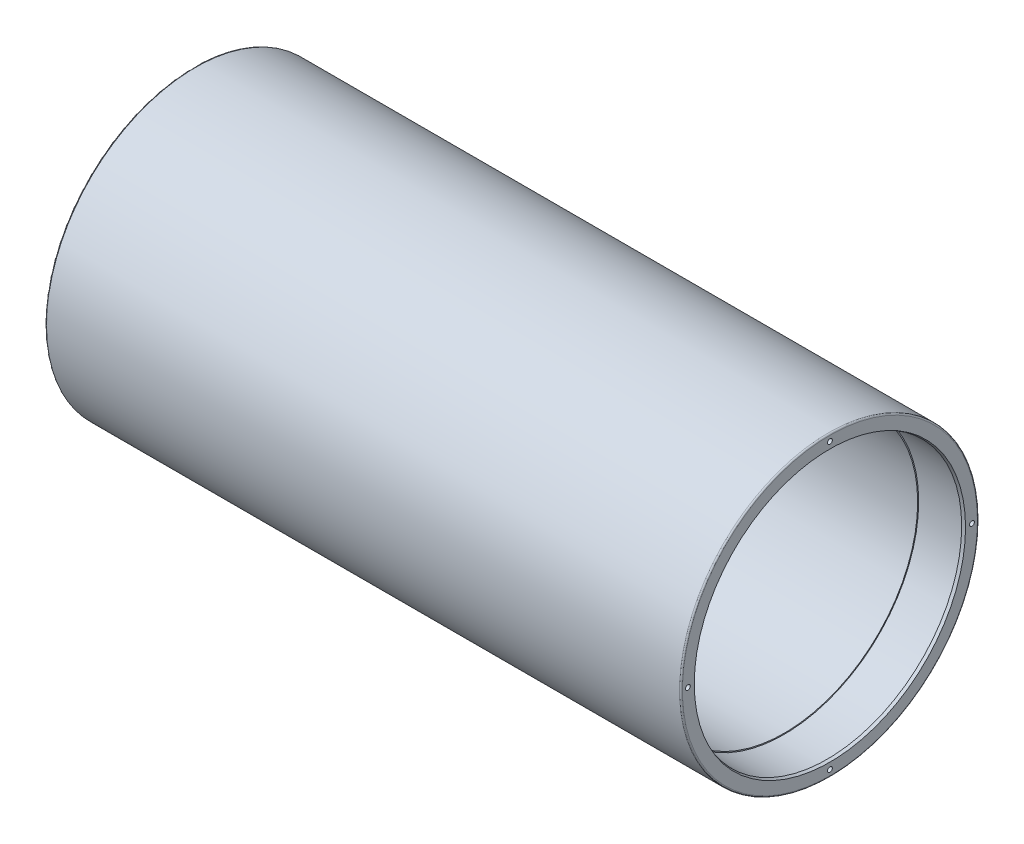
ISO-10303-21;
HEADER;
FILE_DESCRIPTION(('STEP AP214'),'2;1');
FILE_NAME('part.step','',(''),(''),'','','');
FILE_SCHEMA(('AUTOMOTIVE_DESIGN { 1 0 10303 214 1 1 1 1 }'));
ENDSEC;
DATA;
#1=APPLICATION_CONTEXT('core data for automotive mechanical design processes');
#2=APPLICATION_PROTOCOL_DEFINITION('international standard','automotive_design',2000,#1);
#3=PRODUCT_CONTEXT('',#1,'mechanical');
#4=PRODUCT('Part','Part','',(#3));
#5=PRODUCT_RELATED_PRODUCT_CATEGORY('part','',(#4));
#6=PRODUCT_DEFINITION_FORMATION('','',#4);
#7=PRODUCT_DEFINITION_CONTEXT('part definition',#1,'design');
#8=PRODUCT_DEFINITION('design','',#6,#7);
#9=PRODUCT_DEFINITION_SHAPE('','',#8);
#10=(LENGTH_UNIT() NAMED_UNIT(*) SI_UNIT(.MILLI.,.METRE.));
#11=(NAMED_UNIT(*) PLANE_ANGLE_UNIT() SI_UNIT($,.RADIAN.));
#12=(NAMED_UNIT(*) SI_UNIT($,.STERADIAN.) SOLID_ANGLE_UNIT());
#13=UNCERTAINTY_MEASURE_WITH_UNIT(LENGTH_MEASURE(1.E-05),#10,'distance_accuracy_value','');
#14=(GEOMETRIC_REPRESENTATION_CONTEXT(3) GLOBAL_UNCERTAINTY_ASSIGNED_CONTEXT((#13)) GLOBAL_UNIT_ASSIGNED_CONTEXT((#10,
#11,#12)) REPRESENTATION_CONTEXT('',''));
#15=CARTESIAN_POINT('',(0.,0.,0.));
#16=DIRECTION('',(0.,0.,1.));
#17=DIRECTION('',(1.,0.,0.));
#18=AXIS2_PLACEMENT_3D('',#15,#16,#17);
#19=CARTESIAN_POINT('',(196.985032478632,0.,0.));
#20=DIRECTION('',(1.,0.,0.));
#21=DIRECTION('',(0.,0.,-1.));
#22=AXIS2_PLACEMENT_3D('',#19,#20,#21);
#23=CYLINDRICAL_SURFACE('',#22,74.041);
#24=CARTESIAN_POINT('',(46.0593563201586,0.,0.));
#25=DIRECTION('',(1.,0.,0.));
#26=DIRECTION('',(0.,0.,-1.));
#27=AXIS2_PLACEMENT_3D('',#24,#25,#26);
#28=CIRCLE('',#27,74.041);
#29=CARTESIAN_POINT('',(46.0593563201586,0.,-74.041));
#30=VERTEX_POINT('',#29);
#31=EDGE_CURVE('E133',#30,#30,#28,.T.);
#32=ORIENTED_EDGE('',*,*,#31,.F.);
#33=EDGE_LOOP('',(#32));
#34=FACE_BOUND('',#33,.T.);
#35=CARTESIAN_POINT('',(327.025,0.,0.));
#36=DIRECTION('',(1.,0.,0.));
#37=DIRECTION('',(0.,0.,-1.));
#38=AXIS2_PLACEMENT_3D('',#35,#36,#37);
#39=CIRCLE('',#38,74.041);
#40=CARTESIAN_POINT('',(327.025,0.,-74.041));
#41=VERTEX_POINT('',#40);
#42=EDGE_CURVE('E132',#41,#41,#39,.T.);
#43=ORIENTED_EDGE('',*,*,#42,.T.);
#44=EDGE_LOOP('',(#43));
#45=FACE_BOUND('',#44,.T.);
#46=ADVANCED_FACE('F39',(#34,#45),#23,.F.);
#47=CARTESIAN_POINT('',(196.985032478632,0.,0.));
#48=DIRECTION('',(1.,0.,0.));
#49=DIRECTION('',(0.,0.,-1.));
#50=AXIS2_PLACEMENT_3D('',#47,#48,#49);
#51=CYLINDRICAL_SURFACE('',#50,82.55);
#52=CARTESIAN_POINT('',(0.79375000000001,0.,0.));
#53=DIRECTION('',(-1.,0.,0.));
#54=DIRECTION('',(0.,0.,1.));
#55=AXIS2_PLACEMENT_3D('',#52,#53,#54);
#56=CIRCLE('',#55,82.55);
#57=CARTESIAN_POINT('',(0.79375000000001,0.,82.55));
#58=VERTEX_POINT('',#57);
#59=EDGE_CURVE('E156',#58,#58,#56,.F.);
#60=ORIENTED_EDGE('',*,*,#59,.T.);
#61=EDGE_LOOP('',(#60));
#62=FACE_BOUND('',#61,.T.);
#63=CARTESIAN_POINT('',(351.63125,0.,0.));
#64=DIRECTION('',(1.,0.,0.));
#65=DIRECTION('',(0.,0.,-1.));
#66=AXIS2_PLACEMENT_3D('',#63,#64,#65);
#67=CIRCLE('',#66,82.55);
#68=CARTESIAN_POINT('',(351.63125,0.,-82.55));
#69=VERTEX_POINT('',#68);
#70=EDGE_CURVE('E153',#69,#69,#67,.F.);
#71=ORIENTED_EDGE('',*,*,#70,.T.);
#72=EDGE_LOOP('',(#71));
#73=FACE_BOUND('',#72,.T.);
#74=ADVANCED_FACE('F170',(#62,#73),#51,.T.);
#75=CARTESIAN_POINT('',(0.,82.55,0.));
#76=DIRECTION('',(-1.,0.,0.));
#77=DIRECTION('',(0.,0.,1.));
#78=AXIS2_PLACEMENT_3D('',#75,#76,#77);
#79=PLANE('',#78);
#80=CARTESIAN_POINT('',(0.,0.,0.));
#81=DIRECTION('',(-1.,0.,0.));
#82=DIRECTION('',(0.,0.,1.));
#83=AXIS2_PLACEMENT_3D('',#80,#81,#82);
#84=CIRCLE('',#83,81.75625);
#85=CARTESIAN_POINT('',(0.,0.,81.75625));
#86=VERTEX_POINT('',#85);
#87=EDGE_CURVE('E47',#86,#86,#84,.T.);
#88=ORIENTED_EDGE('',*,*,#87,.T.);
#89=EDGE_LOOP('',(#88));
#90=FACE_BOUND('',#89,.T.);
#91=CARTESIAN_POINT('',(0.,0.,0.));
#92=DIRECTION('',(-1.,0.,0.));
#93=DIRECTION('',(0.,0.,1.));
#94=AXIS2_PLACEMENT_3D('',#91,#92,#93);
#95=CIRCLE('',#94,67.2481803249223);
#96=CARTESIAN_POINT('',(0.,0.,67.2481803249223));
#97=VERTEX_POINT('',#96);
#98=EDGE_CURVE('E139',#97,#97,#95,.F.);
#99=ORIENTED_EDGE('',*,*,#98,.T.);
#100=EDGE_LOOP('',(#99));
#101=FACE_BOUND('',#100,.T.);
#102=CARTESIAN_POINT('',(0.,8.24757721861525E-13,78.74));
#103=DIRECTION('',(-1.,0.,0.));
#104=DIRECTION('',(0.,0.,1.));
#105=AXIS2_PLACEMENT_3D('',#102,#103,#104);
#106=CIRCLE('',#105,1.35254999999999);
#107=CARTESIAN_POINT('',(0.,8.24757721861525E-13,80.09255));
#108=VERTEX_POINT('',#107);
#109=EDGE_CURVE('E105',#108,#108,#106,.T.);
#110=ORIENTED_EDGE('',*,*,#109,.F.);
#111=EDGE_LOOP('',(#110));
#112=FACE_BOUND('',#111,.T.);
#113=CARTESIAN_POINT('',(0.,-78.74,0.));
#114=DIRECTION('',(-1.,0.,0.));
#115=DIRECTION('',(0.,0.,1.));
#116=AXIS2_PLACEMENT_3D('',#113,#114,#115);
#117=CIRCLE('',#116,1.35254999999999);
#118=CARTESIAN_POINT('',(0.,-78.74,1.35254999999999));
#119=VERTEX_POINT('',#118);
#120=EDGE_CURVE('E111',#119,#119,#117,.T.);
#121=ORIENTED_EDGE('',*,*,#120,.F.);
#122=EDGE_LOOP('',(#121));
#123=FACE_BOUND('',#122,.T.);
#124=CARTESIAN_POINT('',(0.,-2.74919240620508E-13,-78.74));
#125=DIRECTION('',(-1.,0.,0.));
#126=DIRECTION('',(0.,0.,1.));
#127=AXIS2_PLACEMENT_3D('',#124,#125,#126);
#128=CIRCLE('',#127,1.35254999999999);
#129=CARTESIAN_POINT('',(0.,-2.74919240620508E-13,-77.38745));
#130=VERTEX_POINT('',#129);
#131=EDGE_CURVE('E117',#130,#130,#128,.T.);
#132=ORIENTED_EDGE('',*,*,#131,.F.);
#133=EDGE_LOOP('',(#132));
#134=FACE_BOUND('',#133,.T.);
#135=CARTESIAN_POINT('',(0.,78.74,0.));
#136=DIRECTION('',(-1.,0.,0.));
#137=DIRECTION('',(0.,0.,1.));
#138=AXIS2_PLACEMENT_3D('',#135,#136,#137);
#139=CIRCLE('',#138,1.35254999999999);
#140=CARTESIAN_POINT('',(0.,78.74,1.35254999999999));
#141=VERTEX_POINT('',#140);
#142=EDGE_CURVE('E123',#141,#141,#139,.T.);
#143=ORIENTED_EDGE('',*,*,#142,.F.);
#144=EDGE_LOOP('',(#143));
#145=FACE_BOUND('',#144,.T.);
#146=ADVANCED_FACE('F161',(#90,#101,#112,#123,#134,#145),#79,.T.);
#147=CARTESIAN_POINT('',(196.985032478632,0.,0.));
#148=DIRECTION('',(1.,0.,0.));
#149=DIRECTION('',(0.,0.,-1.));
#150=AXIS2_PLACEMENT_3D('',#147,#148,#149);
#151=CYLINDRICAL_SURFACE('',#150,66.675);
#152=CARTESIAN_POINT('',(1.5747999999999,0.,0.));
#153=DIRECTION('',(-1.,0.,0.));
#154=DIRECTION('',(0.,0.,1.));
#155=AXIS2_PLACEMENT_3D('',#152,#153,#154);
#156=CIRCLE('',#155,66.675);
#157=CARTESIAN_POINT('',(1.5747999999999,0.,66.675));
#158=VERTEX_POINT('',#157);
#159=EDGE_CURVE('E144',#158,#158,#156,.T.);
#160=ORIENTED_EDGE('',*,*,#159,.T.);
#161=EDGE_LOOP('',(#160));
#162=FACE_BOUND('',#161,.T.);
#163=CARTESIAN_POINT('',(18.569070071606,0.,0.));
#164=DIRECTION('',(1.,0.,0.));
#165=DIRECTION('',(0.,0.,-1.));
#166=AXIS2_PLACEMENT_3D('',#163,#164,#165);
#167=CIRCLE('',#166,66.675);
#168=CARTESIAN_POINT('',(18.569070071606,0.,-66.675));
#169=VERTEX_POINT('',#168);
#170=EDGE_CURVE('E136',#169,#169,#167,.T.);
#171=ORIENTED_EDGE('',*,*,#170,.T.);
#172=EDGE_LOOP('',(#171));
#173=FACE_BOUND('',#172,.T.);
#174=ADVANCED_FACE('F224',(#162,#173),#151,.F.);
#175=CARTESIAN_POINT('',(18.569070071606,0.,0.));
#176=DIRECTION('',(1.,0.,0.));
#177=DIRECTION('',(0.,0.,-1.));
#178=AXIS2_PLACEMENT_3D('',#175,#176,#177);
#179=CONICAL_SURFACE('',#178,66.675,0.261799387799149);
#180=ORIENTED_EDGE('',*,*,#31,.T.);
#181=EDGE_LOOP('',(#180));
#182=FACE_BOUND('',#181,.T.);
#183=ORIENTED_EDGE('',*,*,#170,.F.);
#184=EDGE_LOOP('',(#183));
#185=FACE_BOUND('',#184,.T.);
#186=ADVANCED_FACE('F184',(#182,#185),#179,.F.);
#187=CARTESIAN_POINT('',(352.425,74.041,0.));
#188=DIRECTION('',(1.,0.,0.));
#189=DIRECTION('',(0.,0.,-1.));
#190=AXIS2_PLACEMENT_3D('',#187,#188,#189);
#191=PLANE('',#190);
#192=CARTESIAN_POINT('',(352.425,0.,0.));
#193=DIRECTION('',(1.,0.,0.));
#194=DIRECTION('',(0.,0.,-1.));
#195=AXIS2_PLACEMENT_3D('',#192,#193,#194);
#196=CIRCLE('',#195,81.75625);
#197=CARTESIAN_POINT('',(352.425,0.,-81.75625));
#198=VERTEX_POINT('',#197);
#199=EDGE_CURVE('E11',#198,#198,#196,.T.);
#200=ORIENTED_EDGE('',*,*,#199,.T.);
#201=EDGE_LOOP('',(#200));
#202=FACE_BOUND('',#201,.T.);
#203=CARTESIAN_POINT('',(352.425,0.,0.));
#204=DIRECTION('',(1.,0.,0.));
#205=DIRECTION('',(0.,0.,-1.));
#206=AXIS2_PLACEMENT_3D('',#203,#204,#205);
#207=CIRCLE('',#206,75.1856803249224);
#208=CARTESIAN_POINT('',(352.425,0.,-75.1856803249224));
#209=VERTEX_POINT('',#208);
#210=EDGE_CURVE('E147',#209,#209,#207,.F.);
#211=ORIENTED_EDGE('',*,*,#210,.T.);
#212=EDGE_LOOP('',(#211));
#213=FACE_BOUND('',#212,.T.);
#214=CARTESIAN_POINT('',(352.425,8.24757721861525E-13,78.74));
#215=DIRECTION('',(1.,0.,0.));
#216=DIRECTION('',(0.,0.,-1.));
#217=AXIS2_PLACEMENT_3D('',#214,#215,#216);
#218=CIRCLE('',#217,1.35254999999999);
#219=CARTESIAN_POINT('',(352.425,8.24757721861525E-13,77.38745));
#220=VERTEX_POINT('',#219);
#221=EDGE_CURVE('E83',#220,#220,#218,.T.);
#222=ORIENTED_EDGE('',*,*,#221,.F.);
#223=EDGE_LOOP('',(#222));
#224=FACE_BOUND('',#223,.T.);
#225=CARTESIAN_POINT('',(352.425,-78.74,0.));
#226=DIRECTION('',(1.,0.,0.));
#227=DIRECTION('',(0.,0.,-1.));
#228=AXIS2_PLACEMENT_3D('',#225,#226,#227);
#229=CIRCLE('',#228,1.35254999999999);
#230=CARTESIAN_POINT('',(352.425,-78.74,-1.35254999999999));
#231=VERTEX_POINT('',#230);
#232=EDGE_CURVE('E82',#231,#231,#229,.T.);
#233=ORIENTED_EDGE('',*,*,#232,.F.);
#234=EDGE_LOOP('',(#233));
#235=FACE_BOUND('',#234,.T.);
#236=CARTESIAN_POINT('',(352.425,-2.74919240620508E-13,-78.74));
#237=DIRECTION('',(1.,0.,0.));
#238=DIRECTION('',(0.,0.,-1.));
#239=AXIS2_PLACEMENT_3D('',#236,#237,#238);
#240=CIRCLE('',#239,1.35254999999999);
#241=CARTESIAN_POINT('',(352.425,-2.74919240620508E-13,-80.09255));
#242=VERTEX_POINT('',#241);
#243=EDGE_CURVE('E93',#242,#242,#240,.T.);
#244=ORIENTED_EDGE('',*,*,#243,.F.);
#245=EDGE_LOOP('',(#244));
#246=FACE_BOUND('',#245,.T.);
#247=CARTESIAN_POINT('',(352.425,78.74,0.));
#248=DIRECTION('',(1.,0.,0.));
#249=DIRECTION('',(0.,0.,-1.));
#250=AXIS2_PLACEMENT_3D('',#247,#248,#249);
#251=CIRCLE('',#250,1.35254999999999);
#252=CARTESIAN_POINT('',(352.425,78.74,-1.35254999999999));
#253=VERTEX_POINT('',#252);
#254=EDGE_CURVE('E99',#253,#253,#251,.T.);
#255=ORIENTED_EDGE('',*,*,#254,.F.);
#256=EDGE_LOOP('',(#255));
#257=FACE_BOUND('',#256,.T.);
#258=ADVANCED_FACE('F180',(#202,#213,#224,#235,#246,#257),#191,.T.);
#259=CARTESIAN_POINT('',(327.025,74.6125,0.));
#260=DIRECTION('',(1.,0.,0.));
#261=DIRECTION('',(0.,0.,-1.));
#262=AXIS2_PLACEMENT_3D('',#259,#260,#261);
#263=PLANE('',#262);
#264=ORIENTED_EDGE('',*,*,#42,.F.);
#265=EDGE_LOOP('',(#264));
#266=FACE_BOUND('',#265,.T.);
#267=CARTESIAN_POINT('',(327.025,0.,0.));
#268=DIRECTION('',(-1.,0.,0.));
#269=DIRECTION('',(0.,0.,1.));
#270=AXIS2_PLACEMENT_3D('',#267,#268,#269);
#271=CIRCLE('',#270,74.6125);
#272=CARTESIAN_POINT('',(327.025,0.,74.6125));
#273=VERTEX_POINT('',#272);
#274=EDGE_CURVE('E129',#273,#273,#271,.T.);
#275=ORIENTED_EDGE('',*,*,#274,.F.);
#276=EDGE_LOOP('',(#275));
#277=FACE_BOUND('',#276,.T.);
#278=ADVANCED_FACE('F183',(#266,#277),#263,.T.);
#279=CARTESIAN_POINT('',(0.,0.,0.));
#280=DIRECTION('',(-1.,0.,0.));
#281=DIRECTION('',(0.,0.,1.));
#282=AXIS2_PLACEMENT_3D('',#279,#280,#281);
#283=CYLINDRICAL_SURFACE('',#282,74.6125);
#284=CARTESIAN_POINT('',(350.8502,0.,0.));
#285=DIRECTION('',(1.,0.,0.));
#286=DIRECTION('',(0.,0.,-1.));
#287=AXIS2_PLACEMENT_3D('',#284,#285,#286);
#288=CIRCLE('',#287,74.6125);
#289=CARTESIAN_POINT('',(350.8502,0.,-74.6125));
#290=VERTEX_POINT('',#289);
#291=EDGE_CURVE('E150',#290,#290,#288,.T.);
#292=ORIENTED_EDGE('',*,*,#291,.T.);
#293=EDGE_LOOP('',(#292));
#294=FACE_BOUND('',#293,.T.);
#295=ORIENTED_EDGE('',*,*,#274,.T.);
#296=EDGE_LOOP('',(#295));
#297=FACE_BOUND('',#296,.T.);
#298=ADVANCED_FACE('F242',(#294,#297),#283,.F.);
#299=CARTESIAN_POINT('',(9.398,78.74,0.));
#300=DIRECTION('',(-1.,0.,0.));
#301=DIRECTION('',(0.,0.,1.));
#302=AXIS2_PLACEMENT_3D('',#299,#300,#301);
#303=CONICAL_SURFACE('',#302,1.35254999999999,1.02974425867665);
#304=CARTESIAN_POINT('',(10.2106940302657,78.74,0.));
#305=VERTEX_POINT('',#304);
#306=VERTEX_LOOP('',#305);
#307=FACE_BOUND('',#306,.T.);
#308=CARTESIAN_POINT('',(9.398,78.74,0.));
#309=DIRECTION('',(-1.,0.,0.));
#310=DIRECTION('',(0.,0.,1.));
#311=AXIS2_PLACEMENT_3D('',#308,#309,#310);
#312=CIRCLE('',#311,1.35254999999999);
#313=CARTESIAN_POINT('',(9.398,78.74,1.35254999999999));
#314=VERTEX_POINT('',#313);
#315=EDGE_CURVE('E126',#314,#314,#312,.T.);
#316=ORIENTED_EDGE('',*,*,#315,.T.);
#317=EDGE_LOOP('',(#316));
#318=FACE_BOUND('',#317,.T.);
#319=ADVANCED_FACE('F245',(#307,#318),#303,.F.);
#320=CARTESIAN_POINT('',(0.,78.74,0.));
#321=DIRECTION('',(-1.,0.,0.));
#322=DIRECTION('',(0.,0.,1.));
#323=AXIS2_PLACEMENT_3D('',#320,#321,#322);
#324=CYLINDRICAL_SURFACE('',#323,1.35254999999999);
#325=ORIENTED_EDGE('',*,*,#315,.F.);
#326=EDGE_LOOP('',(#325));
#327=FACE_BOUND('',#326,.T.);
#328=ORIENTED_EDGE('',*,*,#142,.T.);
#329=EDGE_LOOP('',(#328));
#330=FACE_BOUND('',#329,.T.);
#331=ADVANCED_FACE('F257',(#327,#330),#324,.F.);
#332=CARTESIAN_POINT('',(9.398,-2.74919240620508E-13,-78.74));
#333=DIRECTION('',(-1.,0.,0.));
#334=DIRECTION('',(0.,0.,1.));
#335=AXIS2_PLACEMENT_3D('',#332,#333,#334);
#336=CONICAL_SURFACE('',#335,1.35255,1.02974425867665);
#337=CARTESIAN_POINT('',(10.2106940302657,-2.77420139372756E-13,-78.74));
#338=VERTEX_POINT('',#337);
#339=VERTEX_LOOP('',#338);
#340=FACE_BOUND('',#339,.T.);
#341=CARTESIAN_POINT('',(9.398,-2.74919240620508E-13,-78.74));
#342=DIRECTION('',(-1.,0.,0.));
#343=DIRECTION('',(0.,0.,1.));
#344=AXIS2_PLACEMENT_3D('',#341,#342,#343);
#345=CIRCLE('',#344,1.35255);
#346=CARTESIAN_POINT('',(9.398,-2.74919240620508E-13,-77.38745));
#347=VERTEX_POINT('',#346);
#348=EDGE_CURVE('E120',#347,#347,#345,.T.);
#349=ORIENTED_EDGE('',*,*,#348,.T.);
#350=EDGE_LOOP('',(#349));
#351=FACE_BOUND('',#350,.T.);
#352=ADVANCED_FACE('F260',(#340,#351),#336,.F.);
#353=CARTESIAN_POINT('',(0.,-2.74919240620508E-13,-78.74));
#354=DIRECTION('',(-1.,0.,0.));
#355=DIRECTION('',(0.,0.,1.));
#356=AXIS2_PLACEMENT_3D('',#353,#354,#355);
#357=CYLINDRICAL_SURFACE('',#356,1.35254999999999);
#358=ORIENTED_EDGE('',*,*,#348,.F.);
#359=EDGE_LOOP('',(#358));
#360=FACE_BOUND('',#359,.T.);
#361=ORIENTED_EDGE('',*,*,#131,.T.);
#362=EDGE_LOOP('',(#361));
#363=FACE_BOUND('',#362,.T.);
#364=ADVANCED_FACE('F264',(#360,#363),#357,.F.);
#365=CARTESIAN_POINT('',(9.398,-78.74,0.));
#366=DIRECTION('',(-1.,0.,0.));
#367=DIRECTION('',(0.,0.,1.));
#368=AXIS2_PLACEMENT_3D('',#365,#366,#367);
#369=CONICAL_SURFACE('',#368,1.35254999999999,1.02974425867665);
#370=CARTESIAN_POINT('',(10.2106940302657,-78.74,0.));
#371=VERTEX_POINT('',#370);
#372=VERTEX_LOOP('',#371);
#373=FACE_BOUND('',#372,.T.);
#374=CARTESIAN_POINT('',(9.398,-78.74,0.));
#375=DIRECTION('',(-1.,0.,0.));
#376=DIRECTION('',(0.,0.,1.));
#377=AXIS2_PLACEMENT_3D('',#374,#375,#376);
#378=CIRCLE('',#377,1.35254999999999);
#379=CARTESIAN_POINT('',(9.398,-78.74,1.35254999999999));
#380=VERTEX_POINT('',#379);
#381=EDGE_CURVE('E114',#380,#380,#378,.T.);
#382=ORIENTED_EDGE('',*,*,#381,.T.);
#383=EDGE_LOOP('',(#382));
#384=FACE_BOUND('',#383,.T.);
#385=ADVANCED_FACE('F267',(#373,#384),#369,.F.);
#386=CARTESIAN_POINT('',(0.,-78.74,0.));
#387=DIRECTION('',(-1.,0.,0.));
#388=DIRECTION('',(0.,0.,1.));
#389=AXIS2_PLACEMENT_3D('',#386,#387,#388);
#390=CYLINDRICAL_SURFACE('',#389,1.35254999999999);
#391=ORIENTED_EDGE('',*,*,#381,.F.);
#392=EDGE_LOOP('',(#391));
#393=FACE_BOUND('',#392,.T.);
#394=ORIENTED_EDGE('',*,*,#120,.T.);
#395=EDGE_LOOP('',(#394));
#396=FACE_BOUND('',#395,.T.);
#397=ADVANCED_FACE('F271',(#393,#396),#390,.F.);
#398=CARTESIAN_POINT('',(9.398,8.24757721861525E-13,78.74));
#399=DIRECTION('',(-1.,0.,0.));
#400=DIRECTION('',(0.,0.,1.));
#401=AXIS2_PLACEMENT_3D('',#398,#399,#400);
#402=CONICAL_SURFACE('',#401,1.35255,1.02974425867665);
#403=CARTESIAN_POINT('',(10.2106940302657,8.22256823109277E-13,78.74));
#404=VERTEX_POINT('',#403);
#405=VERTEX_LOOP('',#404);
#406=FACE_BOUND('',#405,.T.);
#407=CARTESIAN_POINT('',(9.398,8.24757721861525E-13,78.74));
#408=DIRECTION('',(-1.,0.,0.));
#409=DIRECTION('',(0.,0.,1.));
#410=AXIS2_PLACEMENT_3D('',#407,#408,#409);
#411=CIRCLE('',#410,1.35255);
#412=CARTESIAN_POINT('',(9.398,8.24757721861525E-13,80.09255));
#413=VERTEX_POINT('',#412);
#414=EDGE_CURVE('E108',#413,#413,#411,.T.);
#415=ORIENTED_EDGE('',*,*,#414,.T.);
#416=EDGE_LOOP('',(#415));
#417=FACE_BOUND('',#416,.T.);
#418=ADVANCED_FACE('F275',(#406,#417),#402,.F.);
#419=CARTESIAN_POINT('',(0.,8.24757721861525E-13,78.74));
#420=DIRECTION('',(-1.,0.,0.));
#421=DIRECTION('',(0.,0.,1.));
#422=AXIS2_PLACEMENT_3D('',#419,#420,#421);
#423=CYLINDRICAL_SURFACE('',#422,1.35254999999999);
#424=ORIENTED_EDGE('',*,*,#414,.F.);
#425=EDGE_LOOP('',(#424));
#426=FACE_BOUND('',#425,.T.);
#427=ORIENTED_EDGE('',*,*,#109,.T.);
#428=EDGE_LOOP('',(#427));
#429=FACE_BOUND('',#428,.T.);
#430=ADVANCED_FACE('F209',(#426,#429),#423,.F.);
#431=CARTESIAN_POINT('',(343.027,78.74,0.));
#432=DIRECTION('',(1.,0.,0.));
#433=DIRECTION('',(0.,0.,-1.));
#434=AXIS2_PLACEMENT_3D('',#431,#432,#433);
#435=CONICAL_SURFACE('',#434,1.35254999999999,1.02974425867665);
#436=CARTESIAN_POINT('',(342.214305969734,78.74,0.));
#437=VERTEX_POINT('',#436);
#438=VERTEX_LOOP('',#437);
#439=FACE_BOUND('',#438,.T.);
#440=CARTESIAN_POINT('',(343.027,78.74,0.));
#441=DIRECTION('',(1.,0.,0.));
#442=DIRECTION('',(0.,0.,-1.));
#443=AXIS2_PLACEMENT_3D('',#440,#441,#442);
#444=CIRCLE('',#443,1.35254999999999);
#445=CARTESIAN_POINT('',(343.027,78.74,-1.35254999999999));
#446=VERTEX_POINT('',#445);
#447=EDGE_CURVE('E102',#446,#446,#444,.T.);
#448=ORIENTED_EDGE('',*,*,#447,.T.);
#449=EDGE_LOOP('',(#448));
#450=FACE_BOUND('',#449,.T.);
#451=ADVANCED_FACE('F199',(#439,#450),#435,.F.);
#452=CARTESIAN_POINT('',(352.425,78.74,0.));
#453=DIRECTION('',(1.,0.,0.));
#454=DIRECTION('',(0.,0.,-1.));
#455=AXIS2_PLACEMENT_3D('',#452,#453,#454);
#456=CYLINDRICAL_SURFACE('',#455,1.35254999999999);
#457=ORIENTED_EDGE('',*,*,#447,.F.);
#458=EDGE_LOOP('',(#457));
#459=FACE_BOUND('',#458,.T.);
#460=ORIENTED_EDGE('',*,*,#254,.T.);
#461=EDGE_LOOP('',(#460));
#462=FACE_BOUND('',#461,.T.);
#463=ADVANCED_FACE('F196',(#459,#462),#456,.F.);
#464=CARTESIAN_POINT('',(343.027,-2.74919240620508E-13,-78.74));
#465=DIRECTION('',(1.,0.,0.));
#466=DIRECTION('',(0.,0.,-1.));
#467=AXIS2_PLACEMENT_3D('',#464,#465,#466);
#468=CONICAL_SURFACE('',#467,1.35255,1.02974425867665);
#469=CARTESIAN_POINT('',(342.214305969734,-2.77420139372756E-13,-78.74));
#470=VERTEX_POINT('',#469);
#471=VERTEX_LOOP('',#470);
#472=FACE_BOUND('',#471,.T.);
#473=CARTESIAN_POINT('',(343.027,-2.74919240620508E-13,-78.74));
#474=DIRECTION('',(1.,0.,0.));
#475=DIRECTION('',(0.,0.,-1.));
#476=AXIS2_PLACEMENT_3D('',#473,#474,#475);
#477=CIRCLE('',#476,1.35255);
#478=CARTESIAN_POINT('',(343.027,-2.74919240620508E-13,-80.09255));
#479=VERTEX_POINT('',#478);
#480=EDGE_CURVE('E96',#479,#479,#477,.T.);
#481=ORIENTED_EDGE('',*,*,#480,.T.);
#482=EDGE_LOOP('',(#481));
#483=FACE_BOUND('',#482,.T.);
#484=ADVANCED_FACE('F198',(#472,#483),#468,.F.);
#485=CARTESIAN_POINT('',(352.425,-2.74919240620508E-13,-78.74));
#486=DIRECTION('',(1.,0.,0.));
#487=DIRECTION('',(0.,0.,-1.));
#488=AXIS2_PLACEMENT_3D('',#485,#486,#487);
#489=CYLINDRICAL_SURFACE('',#488,1.35254999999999);
#490=ORIENTED_EDGE('',*,*,#480,.F.);
#491=EDGE_LOOP('',(#490));
#492=FACE_BOUND('',#491,.T.);
#493=ORIENTED_EDGE('',*,*,#243,.T.);
#494=EDGE_LOOP('',(#493));
#495=FACE_BOUND('',#494,.T.);
#496=ADVANCED_FACE('F206',(#492,#495),#489,.F.);
#497=CARTESIAN_POINT('',(343.027,-78.74,0.));
#498=DIRECTION('',(1.,0.,0.));
#499=DIRECTION('',(0.,0.,-1.));
#500=AXIS2_PLACEMENT_3D('',#497,#498,#499);
#501=CONICAL_SURFACE('',#500,1.35254999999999,1.02974425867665);
#502=CARTESIAN_POINT('',(342.214305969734,-78.74,0.));
#503=VERTEX_POINT('',#502);
#504=VERTEX_LOOP('',#503);
#505=FACE_BOUND('',#504,.T.);
#506=CARTESIAN_POINT('',(343.027,-78.74,0.));
#507=DIRECTION('',(1.,0.,0.));
#508=DIRECTION('',(0.,0.,-1.));
#509=AXIS2_PLACEMENT_3D('',#506,#507,#508);
#510=CIRCLE('',#509,1.35254999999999);
#511=CARTESIAN_POINT('',(343.027,-78.74,-1.35254999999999));
#512=VERTEX_POINT('',#511);
#513=EDGE_CURVE('E86',#512,#512,#510,.T.);
#514=ORIENTED_EDGE('',*,*,#513,.T.);
#515=EDGE_LOOP('',(#514));
#516=FACE_BOUND('',#515,.T.);
#517=ADVANCED_FACE('F336',(#505,#516),#501,.F.);
#518=CARTESIAN_POINT('',(352.425,-78.74,0.));
#519=DIRECTION('',(1.,0.,0.));
#520=DIRECTION('',(0.,0.,-1.));
#521=AXIS2_PLACEMENT_3D('',#518,#519,#520);
#522=CYLINDRICAL_SURFACE('',#521,1.35254999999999);
#523=ORIENTED_EDGE('',*,*,#513,.F.);
#524=EDGE_LOOP('',(#523));
#525=FACE_BOUND('',#524,.T.);
#526=ORIENTED_EDGE('',*,*,#232,.T.);
#527=EDGE_LOOP('',(#526));
#528=FACE_BOUND('',#527,.T.);
#529=ADVANCED_FACE('F76',(#525,#528),#522,.F.);
#530=CARTESIAN_POINT('',(343.027,8.24757721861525E-13,78.74));
#531=DIRECTION('',(1.,0.,0.));
#532=DIRECTION('',(0.,0.,-1.));
#533=AXIS2_PLACEMENT_3D('',#530,#531,#532);
#534=CONICAL_SURFACE('',#533,1.35255,1.02974425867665);
#535=CARTESIAN_POINT('',(342.214305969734,8.22256823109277E-13,78.74));
#536=VERTEX_POINT('',#535);
#537=VERTEX_LOOP('',#536);
#538=FACE_BOUND('',#537,.T.);
#539=CARTESIAN_POINT('',(343.027,8.24757721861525E-13,78.74));
#540=DIRECTION('',(1.,0.,0.));
#541=DIRECTION('',(0.,0.,-1.));
#542=AXIS2_PLACEMENT_3D('',#539,#540,#541);
#543=CIRCLE('',#542,1.35255);
#544=CARTESIAN_POINT('',(343.027,8.24757721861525E-13,77.38745));
#545=VERTEX_POINT('',#544);
#546=EDGE_CURVE('E80',#545,#545,#543,.T.);
#547=ORIENTED_EDGE('',*,*,#546,.T.);
#548=EDGE_LOOP('',(#547));
#549=FACE_BOUND('',#548,.T.);
#550=ADVANCED_FACE('F72',(#538,#549),#534,.F.);
#551=CARTESIAN_POINT('',(352.425,8.24757721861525E-13,78.74));
#552=DIRECTION('',(1.,0.,0.));
#553=DIRECTION('',(0.,0.,-1.));
#554=AXIS2_PLACEMENT_3D('',#551,#552,#553);
#555=CYLINDRICAL_SURFACE('',#554,1.35254999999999);
#556=ORIENTED_EDGE('',*,*,#546,.F.);
#557=EDGE_LOOP('',(#556));
#558=FACE_BOUND('',#557,.T.);
#559=ORIENTED_EDGE('',*,*,#221,.T.);
#560=EDGE_LOOP('',(#559));
#561=FACE_BOUND('',#560,.T.);
#562=ADVANCED_FACE('F75',(#558,#561),#555,.F.);
#563=CARTESIAN_POINT('',(0.,0.,0.));
#564=DIRECTION('',(-1.,0.,0.));
#565=DIRECTION('',(0.,0.,1.));
#566=AXIS2_PLACEMENT_3D('',#563,#564,#565);
#567=CONICAL_SURFACE('',#566,67.2481803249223,0.34906585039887);
#568=ORIENTED_EDGE('',*,*,#159,.F.);
#569=EDGE_LOOP('',(#568));
#570=FACE_BOUND('',#569,.T.);
#571=ORIENTED_EDGE('',*,*,#98,.F.);
#572=EDGE_LOOP('',(#571));
#573=FACE_BOUND('',#572,.T.);
#574=ADVANCED_FACE('F231',(#570,#573),#567,.F.);
#575=CARTESIAN_POINT('',(352.425,0.,0.));
#576=DIRECTION('',(1.,0.,0.));
#577=DIRECTION('',(0.,0.,-1.));
#578=AXIS2_PLACEMENT_3D('',#575,#576,#577);
#579=CONICAL_SURFACE('',#578,75.1856803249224,0.349065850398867);
#580=ORIENTED_EDGE('',*,*,#291,.F.);
#581=EDGE_LOOP('',(#580));
#582=FACE_BOUND('',#581,.T.);
#583=ORIENTED_EDGE('',*,*,#210,.F.);
#584=EDGE_LOOP('',(#583));
#585=FACE_BOUND('',#584,.T.);
#586=ADVANCED_FACE('F167',(#582,#585),#579,.F.);
#587=CARTESIAN_POINT('',(0.79375000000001,0.,0.));
#588=DIRECTION('',(-1.,0.,0.));
#589=DIRECTION('',(0.,0.,1.));
#590=AXIS2_PLACEMENT_3D('',#587,#588,#589);
#591=TOROIDAL_SURFACE('',#590,81.75625,0.79375);
#592=ORIENTED_EDGE('',*,*,#87,.F.);
#593=EDGE_LOOP('',(#592));
#594=FACE_BOUND('',#593,.T.);
#595=ORIENTED_EDGE('',*,*,#59,.F.);
#596=EDGE_LOOP('',(#595));
#597=FACE_BOUND('',#596,.T.);
#598=ADVANCED_FACE('F164',(#594,#597),#591,.T.);
#599=CARTESIAN_POINT('',(351.63125,0.,0.));
#600=DIRECTION('',(1.,0.,0.));
#601=DIRECTION('',(0.,0.,-1.));
#602=AXIS2_PLACEMENT_3D('',#599,#600,#601);
#603=TOROIDAL_SURFACE('',#602,81.75625,0.79375);
#604=ORIENTED_EDGE('',*,*,#70,.F.);
#605=EDGE_LOOP('',(#604));
#606=FACE_BOUND('',#605,.T.);
#607=ORIENTED_EDGE('',*,*,#199,.F.);
#608=EDGE_LOOP('',(#607));
#609=FACE_BOUND('',#608,.T.);
#610=ADVANCED_FACE('F41',(#606,#609),#603,.T.);
#611=CLOSED_SHELL('',(#46,#74,#146,#174,#186,#258,#278,#298,#319,#331,#352,#364,#385,#397,#418,
#430,#451,#463,#484,#496,#517,#529,#550,#562,#574,#586,#598,#610));
#612=MANIFOLD_SOLID_BREP('B2',#611);
#613=ADVANCED_BREP_SHAPE_REPRESENTATION('',(#18,#612),#14);
#614=SHAPE_DEFINITION_REPRESENTATION(#9,#613);
ENDSEC;
END-ISO-10303-21;
